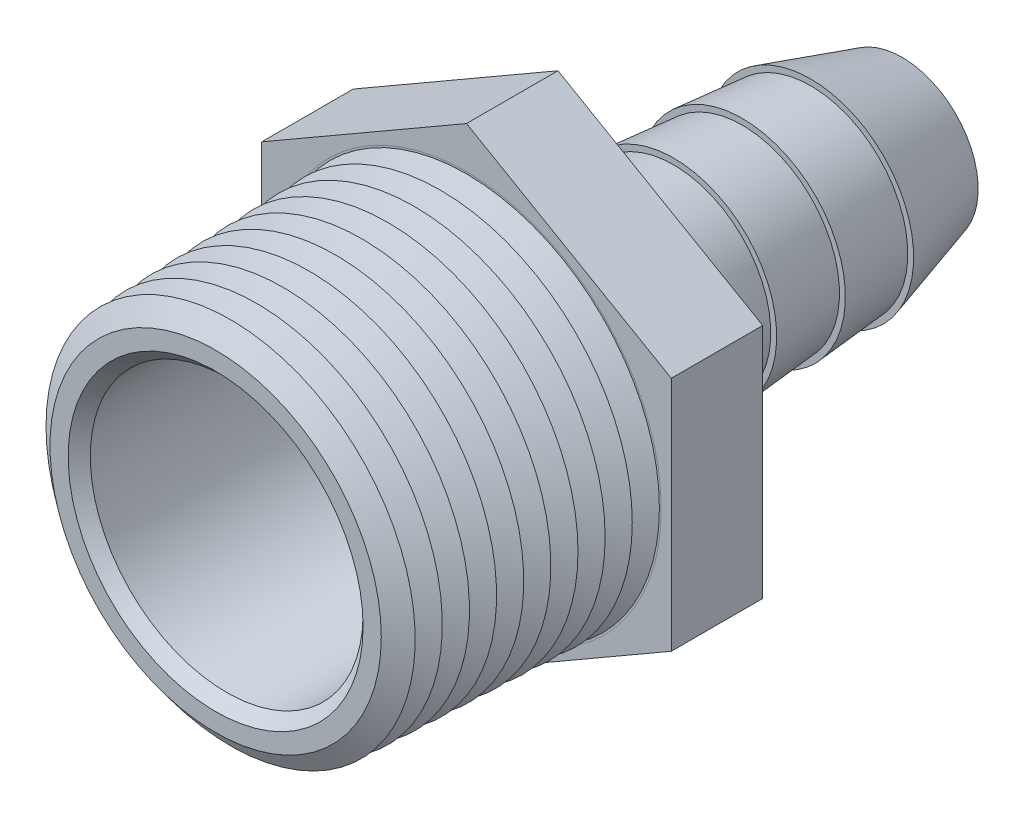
ISO-10303-21;
HEADER;
FILE_DESCRIPTION(('STEP AP214'),'2;1');
FILE_NAME('part.step','',(''),(''),'','','');
FILE_SCHEMA(('AUTOMOTIVE_DESIGN { 1 0 10303 214 1 1 1 1 }'));
ENDSEC;
DATA;
#1=APPLICATION_CONTEXT('core data for automotive mechanical design processes');
#2=APPLICATION_PROTOCOL_DEFINITION('international standard','automotive_design',2000,#1);
#3=PRODUCT_CONTEXT('',#1,'mechanical');
#4=PRODUCT('Part','Part','',(#3));
#5=PRODUCT_RELATED_PRODUCT_CATEGORY('part','',(#4));
#6=PRODUCT_DEFINITION_FORMATION('','',#4);
#7=PRODUCT_DEFINITION_CONTEXT('part definition',#1,'design');
#8=PRODUCT_DEFINITION('design','',#6,#7);
#9=PRODUCT_DEFINITION_SHAPE('','',#8);
#10=(LENGTH_UNIT() NAMED_UNIT(*) SI_UNIT(.MILLI.,.METRE.));
#11=(NAMED_UNIT(*) PLANE_ANGLE_UNIT() SI_UNIT($,.RADIAN.));
#12=(NAMED_UNIT(*) SI_UNIT($,.STERADIAN.) SOLID_ANGLE_UNIT());
#13=UNCERTAINTY_MEASURE_WITH_UNIT(LENGTH_MEASURE(1.E-05),#10,'distance_accuracy_value','');
#14=(GEOMETRIC_REPRESENTATION_CONTEXT(3) GLOBAL_UNCERTAINTY_ASSIGNED_CONTEXT((#13)) GLOBAL_UNIT_ASSIGNED_CONTEXT((#10,
#11,#12)) REPRESENTATION_CONTEXT('',''));
#15=CARTESIAN_POINT('',(0.,0.,0.));
#16=DIRECTION('',(0.,0.,1.));
#17=DIRECTION('',(1.,0.,0.));
#18=AXIS2_PLACEMENT_3D('',#15,#16,#17);
#19=CARTESIAN_POINT('',(14.1605,-8.1755684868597,30.1244));
#20=DIRECTION('',(0.,0.,1.));
#21=DIRECTION('',(1.,0.,0.));
#22=AXIS2_PLACEMENT_3D('',#19,#20,#21);
#23=PLANE('',#22);
#24=DIRECTION('',(0.866025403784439,0.5,0.));
#25=VECTOR('',#24,1.);
#26=CARTESIAN_POINT('',(0.,-16.3511369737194,30.1244));
#27=LINE('',#26,#25);
#28=CARTESIAN_POINT('',(0.,-16.3511369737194,30.1244));
#29=VERTEX_POINT('',#28);
#30=CARTESIAN_POINT('',(14.1605,-8.1755684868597,30.1244));
#31=VERTEX_POINT('',#30);
#32=EDGE_CURVE('E127',#29,#31,#27,.T.);
#33=ORIENTED_EDGE('',*,*,#32,.T.);
#34=DIRECTION('',(0.,1.,0.));
#35=VECTOR('',#34,1.);
#36=CARTESIAN_POINT('',(14.1605,-8.1755684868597,30.1244));
#37=LINE('',#36,#35);
#38=CARTESIAN_POINT('',(14.1605,8.1755684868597,30.1244));
#39=VERTEX_POINT('',#38);
#40=EDGE_CURVE('E104',#31,#39,#37,.T.);
#41=ORIENTED_EDGE('',*,*,#40,.T.);
#42=DIRECTION('',(-0.866025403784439,0.5,0.));
#43=VECTOR('',#42,1.);
#44=CARTESIAN_POINT('',(14.1605,8.1755684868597,30.1244));
#45=LINE('',#44,#43);
#46=CARTESIAN_POINT('',(0.,16.3511369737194,30.1244));
#47=VERTEX_POINT('',#46);
#48=EDGE_CURVE('E130',#39,#47,#45,.T.);
#49=ORIENTED_EDGE('',*,*,#48,.T.);
#50=DIRECTION('',(-0.866025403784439,-0.5,0.));
#51=VECTOR('',#50,1.);
#52=CARTESIAN_POINT('',(0.,16.3511369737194,30.1244));
#53=LINE('',#52,#51);
#54=CARTESIAN_POINT('',(-14.1605,8.1755684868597,30.1244));
#55=VERTEX_POINT('',#54);
#56=EDGE_CURVE('E132',#47,#55,#53,.T.);
#57=ORIENTED_EDGE('',*,*,#56,.T.);
#58=DIRECTION('',(0.,-1.,0.));
#59=VECTOR('',#58,1.);
#60=CARTESIAN_POINT('',(-14.1605,8.1755684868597,30.1244));
#61=LINE('',#60,#59);
#62=CARTESIAN_POINT('',(-14.1605,-8.17556848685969,30.1244));
#63=VERTEX_POINT('',#62);
#64=EDGE_CURVE('E55',#55,#63,#61,.T.);
#65=ORIENTED_EDGE('',*,*,#64,.T.);
#66=DIRECTION('',(0.866025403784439,-0.5,0.));
#67=VECTOR('',#66,1.);
#68=CARTESIAN_POINT('',(-14.1605,-8.17556848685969,30.1244));
#69=LINE('',#68,#67);
#70=EDGE_CURVE('E50',#63,#29,#69,.T.);
#71=ORIENTED_EDGE('',*,*,#70,.T.);
#72=EDGE_LOOP('',(#33,#41,#49,#57,#65,#71));
#73=FACE_BOUND('',#72,.T.);
#74=CARTESIAN_POINT('',(0.,0.,30.1244));
#75=DIRECTION('',(0.,0.,-1.));
#76=DIRECTION('',(-1.,0.,0.));
#77=AXIS2_PLACEMENT_3D('',#74,#75,#76);
#78=CIRCLE('',#77,13.46835);
#79=CARTESIAN_POINT('',(-13.46835,0.,30.1244));
#80=VERTEX_POINT('',#79);
#81=EDGE_CURVE('E614',#80,#80,#78,.T.);
#82=ORIENTED_EDGE('',*,*,#81,.T.);
#83=EDGE_LOOP('',(#82));
#84=FACE_BOUND('',#83,.T.);
#85=ADVANCED_FACE('F34',(#73,#84),#23,.T.);
#86=CARTESIAN_POINT('',(0.,0.,47.4726));
#87=DIRECTION('',(0.,0.,1.));
#88=DIRECTION('',(1.,0.,0.));
#89=AXIS2_PLACEMENT_3D('',#86,#87,#88);
#90=PLANE('',#89);
#91=CARTESIAN_POINT('',(0.,0.,47.4726));
#92=DIRECTION('',(0.,0.,1.));
#93=DIRECTION('',(1.,0.,0.));
#94=AXIS2_PLACEMENT_3D('',#91,#92,#93);
#95=CIRCLE('',#94,10.1981);
#96=CARTESIAN_POINT('',(10.1981,0.,47.4726));
#97=VERTEX_POINT('',#96);
#98=EDGE_CURVE('E11',#97,#97,#95,.F.);
#99=ORIENTED_EDGE('',*,*,#98,.T.);
#100=EDGE_LOOP('',(#99));
#101=FACE_BOUND('',#100,.T.);
#102=CARTESIAN_POINT('',(0.,0.,47.4726));
#103=DIRECTION('',(0.,0.,1.));
#104=DIRECTION('',(1.,0.,0.));
#105=AXIS2_PLACEMENT_3D('',#102,#103,#104);
#106=CIRCLE('',#105,11.4553988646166);
#107=CARTESIAN_POINT('',(11.4553988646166,0.,47.4726));
#108=VERTEX_POINT('',#107);
#109=EDGE_CURVE('E38',#108,#108,#106,.T.);
#110=ORIENTED_EDGE('',*,*,#109,.T.);
#111=EDGE_LOOP('',(#110));
#112=FACE_BOUND('',#111,.T.);
#113=ADVANCED_FACE('F195',(#101,#112),#90,.T.);
#114=CARTESIAN_POINT('',(0.,0.,6.3246));
#115=DIRECTION('',(0.,0.,1.));
#116=DIRECTION('',(1.,0.,0.));
#117=AXIS2_PLACEMENT_3D('',#114,#115,#116);
#118=CONICAL_SURFACE('',#117,7.1247,0.287029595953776);
#119=CARTESIAN_POINT('',(0.,0.,0.));
#120=DIRECTION('',(0.,0.,-1.));
#121=DIRECTION('',(-1.,0.,0.));
#122=AXIS2_PLACEMENT_3D('',#119,#120,#121);
#123=CIRCLE('',#122,5.2578);
#124=CARTESIAN_POINT('',(-5.2578,0.,0.));
#125=VERTEX_POINT('',#124);
#126=EDGE_CURVE('E167',#125,#125,#123,.T.);
#127=ORIENTED_EDGE('',*,*,#126,.F.);
#128=EDGE_LOOP('',(#127));
#129=FACE_BOUND('',#128,.T.);
#130=CARTESIAN_POINT('',(0.,0.,6.3246));
#131=DIRECTION('',(0.,0.,-1.));
#132=DIRECTION('',(-1.,0.,0.));
#133=AXIS2_PLACEMENT_3D('',#130,#131,#132);
#134=CIRCLE('',#133,7.1247);
#135=CARTESIAN_POINT('',(-7.1247,0.,6.3246));
#136=VERTEX_POINT('',#135);
#137=EDGE_CURVE('E107',#136,#136,#134,.T.);
#138=ORIENTED_EDGE('',*,*,#137,.T.);
#139=EDGE_LOOP('',(#138));
#140=FACE_BOUND('',#139,.T.);
#141=ADVANCED_FACE('F200',(#129,#140),#118,.T.);
#142=CARTESIAN_POINT('',(0.,0.,20.5232));
#143=DIRECTION('',(0.,0.,1.));
#144=DIRECTION('',(1.,0.,0.));
#145=AXIS2_PLACEMENT_3D('',#142,#143,#144);
#146=CONICAL_SURFACE('',#145,7.1247,0.0858102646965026);
#147=CARTESIAN_POINT('',(0.,0.,15.7988));
#148=DIRECTION('',(0.,0.,-1.));
#149=DIRECTION('',(-1.,0.,0.));
#150=AXIS2_PLACEMENT_3D('',#147,#148,#149);
#151=CIRCLE('',#150,6.7183);
#152=CARTESIAN_POINT('',(-6.7183,0.,15.7988));
#153=VERTEX_POINT('',#152);
#154=EDGE_CURVE('E161',#153,#153,#151,.T.);
#155=ORIENTED_EDGE('',*,*,#154,.F.);
#156=EDGE_LOOP('',(#155));
#157=FACE_BOUND('',#156,.T.);
#158=CARTESIAN_POINT('',(0.,0.,20.5232));
#159=DIRECTION('',(0.,0.,-1.));
#160=DIRECTION('',(-1.,0.,0.));
#161=AXIS2_PLACEMENT_3D('',#158,#159,#160);
#162=CIRCLE('',#161,7.1247);
#163=CARTESIAN_POINT('',(-7.1247,0.,20.5232));
#164=VERTEX_POINT('',#163);
#165=EDGE_CURVE('E164',#164,#164,#162,.T.);
#166=ORIENTED_EDGE('',*,*,#165,.T.);
#167=EDGE_LOOP('',(#166));
#168=FACE_BOUND('',#167,.T.);
#169=ADVANCED_FACE('F247',(#157,#168),#146,.T.);
#170=CARTESIAN_POINT('',(-7.1247,0.,15.7988));
#171=DIRECTION('',(0.,0.,-1.));
#172=DIRECTION('',(-1.,0.,0.));
#173=AXIS2_PLACEMENT_3D('',#170,#171,#172);
#174=PLANE('',#173);
#175=CARTESIAN_POINT('',(0.,0.,15.7988));
#176=DIRECTION('',(0.,0.,-1.));
#177=DIRECTION('',(-1.,0.,0.));
#178=AXIS2_PLACEMENT_3D('',#175,#176,#177);
#179=CIRCLE('',#178,7.1247);
#180=CARTESIAN_POINT('',(-7.1247,0.,15.7988));
#181=VERTEX_POINT('',#180);
#182=EDGE_CURVE('E158',#181,#181,#179,.T.);
#183=ORIENTED_EDGE('',*,*,#182,.F.);
#184=EDGE_LOOP('',(#183));
#185=FACE_BOUND('',#184,.T.);
#186=ORIENTED_EDGE('',*,*,#154,.T.);
#187=EDGE_LOOP('',(#186));
#188=FACE_BOUND('',#187,.T.);
#189=ADVANCED_FACE('F243',(#185,#188),#174,.F.);
#190=CARTESIAN_POINT('',(0.,0.,15.7988));
#191=DIRECTION('',(0.,0.,1.));
#192=DIRECTION('',(1.,0.,0.));
#193=AXIS2_PLACEMENT_3D('',#190,#191,#192);
#194=CONICAL_SURFACE('',#193,7.1247,0.0853536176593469);
#195=CARTESIAN_POINT('',(0.,0.,11.049));
#196=DIRECTION('',(0.,0.,-1.));
#197=DIRECTION('',(-1.,0.,0.));
#198=AXIS2_PLACEMENT_3D('',#195,#196,#197);
#199=CIRCLE('',#198,6.7183);
#200=CARTESIAN_POINT('',(-6.7183,0.,11.049));
#201=VERTEX_POINT('',#200);
#202=EDGE_CURVE('E155',#201,#201,#199,.T.);
#203=ORIENTED_EDGE('',*,*,#202,.F.);
#204=EDGE_LOOP('',(#203));
#205=FACE_BOUND('',#204,.T.);
#206=ORIENTED_EDGE('',*,*,#182,.T.);
#207=EDGE_LOOP('',(#206));
#208=FACE_BOUND('',#207,.T.);
#209=ADVANCED_FACE('F239',(#205,#208),#194,.T.);
#210=CARTESIAN_POINT('',(-7.1247,0.,11.049));
#211=DIRECTION('',(0.,0.,-1.));
#212=DIRECTION('',(-1.,0.,0.));
#213=AXIS2_PLACEMENT_3D('',#210,#211,#212);
#214=PLANE('',#213);
#215=CARTESIAN_POINT('',(0.,0.,11.049));
#216=DIRECTION('',(0.,0.,-1.));
#217=DIRECTION('',(-1.,0.,0.));
#218=AXIS2_PLACEMENT_3D('',#215,#216,#217);
#219=CIRCLE('',#218,7.1247);
#220=CARTESIAN_POINT('',(-7.1247,0.,11.049));
#221=VERTEX_POINT('',#220);
#222=EDGE_CURVE('E152',#221,#221,#219,.T.);
#223=ORIENTED_EDGE('',*,*,#222,.F.);
#224=EDGE_LOOP('',(#223));
#225=FACE_BOUND('',#224,.T.);
#226=ORIENTED_EDGE('',*,*,#202,.T.);
#227=EDGE_LOOP('',(#226));
#228=FACE_BOUND('',#227,.T.);
#229=ADVANCED_FACE('F235',(#225,#228),#214,.F.);
#230=CARTESIAN_POINT('',(0.,0.,11.049));
#231=DIRECTION('',(0.,0.,1.));
#232=DIRECTION('',(1.,0.,0.));
#233=AXIS2_PLACEMENT_3D('',#230,#231,#232);
#234=CONICAL_SURFACE('',#233,7.1247,0.0858102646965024);
#235=CARTESIAN_POINT('',(0.,0.,6.3246));
#236=DIRECTION('',(0.,0.,-1.));
#237=DIRECTION('',(-1.,0.,0.));
#238=AXIS2_PLACEMENT_3D('',#235,#236,#237);
#239=CIRCLE('',#238,6.7183);
#240=CARTESIAN_POINT('',(-6.7183,0.,6.3246));
#241=VERTEX_POINT('',#240);
#242=EDGE_CURVE('E149',#241,#241,#239,.T.);
#243=ORIENTED_EDGE('',*,*,#242,.F.);
#244=EDGE_LOOP('',(#243));
#245=FACE_BOUND('',#244,.T.);
#246=ORIENTED_EDGE('',*,*,#222,.T.);
#247=EDGE_LOOP('',(#246));
#248=FACE_BOUND('',#247,.T.);
#249=ADVANCED_FACE('F231',(#245,#248),#234,.T.);
#250=CARTESIAN_POINT('',(-7.1247,0.,6.3246));
#251=DIRECTION('',(0.,0.,-1.));
#252=DIRECTION('',(-1.,0.,0.));
#253=AXIS2_PLACEMENT_3D('',#250,#251,#252);
#254=PLANE('',#253);
#255=ORIENTED_EDGE('',*,*,#137,.F.);
#256=EDGE_LOOP('',(#255));
#257=FACE_BOUND('',#256,.T.);
#258=ORIENTED_EDGE('',*,*,#242,.T.);
#259=EDGE_LOOP('',(#258));
#260=FACE_BOUND('',#259,.T.);
#261=ADVANCED_FACE('F227',(#257,#260),#254,.F.);
#262=CARTESIAN_POINT('',(0.,0.,0.));
#263=DIRECTION('',(0.,0.,1.));
#264=DIRECTION('',(1.,0.,0.));
#265=AXIS2_PLACEMENT_3D('',#262,#263,#264);
#266=PLANE('',#265);
#267=CARTESIAN_POINT('',(0.,0.,0.));
#268=DIRECTION('',(0.,0.,-1.));
#269=DIRECTION('',(-1.,0.,0.));
#270=AXIS2_PLACEMENT_3D('',#267,#268,#269);
#271=CIRCLE('',#270,4.6482);
#272=CARTESIAN_POINT('',(-4.6482,0.,0.));
#273=VERTEX_POINT('',#272);
#274=EDGE_CURVE('E113',#273,#273,#271,.T.);
#275=ORIENTED_EDGE('',*,*,#274,.F.);
#276=EDGE_LOOP('',(#275));
#277=FACE_BOUND('',#276,.T.);
#278=ORIENTED_EDGE('',*,*,#126,.T.);
#279=EDGE_LOOP('',(#278));
#280=FACE_BOUND('',#279,.T.);
#281=ADVANCED_FACE('F230',(#277,#280),#266,.F.);
#282=CARTESIAN_POINT('',(0.,0.,23.7998));
#283=DIRECTION('',(0.,0.,-1.));
#284=DIRECTION('',(-1.,0.,0.));
#285=AXIS2_PLACEMENT_3D('',#282,#283,#284);
#286=CYLINDRICAL_SURFACE('',#285,7.1247);
#287=ORIENTED_EDGE('',*,*,#165,.F.);
#288=EDGE_LOOP('',(#287));
#289=FACE_BOUND('',#288,.T.);
#290=CARTESIAN_POINT('',(0.,0.,23.7998));
#291=DIRECTION('',(0.,0.,1.));
#292=DIRECTION('',(1.,0.,0.));
#293=AXIS2_PLACEMENT_3D('',#290,#291,#292);
#294=CIRCLE('',#293,7.1247);
#295=CARTESIAN_POINT('',(7.1247,0.,23.7998));
#296=VERTEX_POINT('',#295);
#297=EDGE_CURVE('E170',#296,#296,#294,.T.);
#298=ORIENTED_EDGE('',*,*,#297,.F.);
#299=EDGE_LOOP('',(#298));
#300=FACE_BOUND('',#299,.T.);
#301=ADVANCED_FACE('F36',(#289,#300),#286,.T.);
#302=CARTESIAN_POINT('',(14.1605,-8.1755684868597,23.7998));
#303=DIRECTION('',(0.,0.,1.));
#304=DIRECTION('',(1.,0.,0.));
#305=AXIS2_PLACEMENT_3D('',#302,#303,#304);
#306=PLANE('',#305);
#307=DIRECTION('',(0.866025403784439,0.5,0.));
#308=VECTOR('',#307,1.);
#309=CARTESIAN_POINT('',(0.,-16.3511369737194,23.7998));
#310=LINE('',#309,#308);
#311=CARTESIAN_POINT('',(0.,-16.3511369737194,23.7998));
#312=VERTEX_POINT('',#311);
#313=CARTESIAN_POINT('',(14.1605,-8.1755684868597,23.7998));
#314=VERTEX_POINT('',#313);
#315=EDGE_CURVE('E94',#312,#314,#310,.T.);
#316=ORIENTED_EDGE('',*,*,#315,.F.);
#317=DIRECTION('',(0.866025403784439,-0.5,0.));
#318=VECTOR('',#317,1.);
#319=CARTESIAN_POINT('',(-14.1605,-8.17556848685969,23.7998));
#320=LINE('',#319,#318);
#321=CARTESIAN_POINT('',(-14.1605,-8.17556848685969,23.7998));
#322=VERTEX_POINT('',#321);
#323=EDGE_CURVE('E125',#322,#312,#320,.T.);
#324=ORIENTED_EDGE('',*,*,#323,.F.);
#325=DIRECTION('',(0.,-1.,0.));
#326=VECTOR('',#325,1.);
#327=CARTESIAN_POINT('',(-14.1605,8.1755684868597,23.7998));
#328=LINE('',#327,#326);
#329=CARTESIAN_POINT('',(-14.1605,8.1755684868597,23.7998));
#330=VERTEX_POINT('',#329);
#331=EDGE_CURVE('E123',#330,#322,#328,.T.);
#332=ORIENTED_EDGE('',*,*,#331,.F.);
#333=DIRECTION('',(-0.866025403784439,-0.5,0.));
#334=VECTOR('',#333,1.);
#335=CARTESIAN_POINT('',(0.,16.3511369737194,23.7998));
#336=LINE('',#335,#334);
#337=CARTESIAN_POINT('',(0.,16.3511369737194,23.7998));
#338=VERTEX_POINT('',#337);
#339=EDGE_CURVE('E121',#338,#330,#336,.T.);
#340=ORIENTED_EDGE('',*,*,#339,.F.);
#341=DIRECTION('',(-0.866025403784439,0.5,0.));
#342=VECTOR('',#341,1.);
#343=CARTESIAN_POINT('',(14.1605,8.1755684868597,23.7998));
#344=LINE('',#343,#342);
#345=CARTESIAN_POINT('',(14.1605,8.1755684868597,23.7998));
#346=VERTEX_POINT('',#345);
#347=EDGE_CURVE('E96',#346,#338,#344,.T.);
#348=ORIENTED_EDGE('',*,*,#347,.F.);
#349=DIRECTION('',(0.,1.,0.));
#350=VECTOR('',#349,1.);
#351=CARTESIAN_POINT('',(14.1605,-8.1755684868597,23.7998));
#352=LINE('',#351,#350);
#353=EDGE_CURVE('E88',#314,#346,#352,.T.);
#354=ORIENTED_EDGE('',*,*,#353,.F.);
#355=EDGE_LOOP('',(#316,#324,#332,#340,#348,#354));
#356=FACE_BOUND('',#355,.T.);
#357=ORIENTED_EDGE('',*,*,#297,.T.);
#358=EDGE_LOOP('',(#357));
#359=FACE_BOUND('',#358,.T.);
#360=ADVANCED_FACE('F90',(#356,#359),#306,.F.);
#361=CARTESIAN_POINT('',(0.,-16.3511369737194,30.1244));
#362=DIRECTION('',(-0.5,0.866025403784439,0.));
#363=DIRECTION('',(-0.866025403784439,-0.5,0.));
#364=AXIS2_PLACEMENT_3D('',#361,#362,#363);
#365=PLANE('',#364);
#366=ORIENTED_EDGE('',*,*,#315,.T.);
#367=DIRECTION('',(0.,0.,-1.));
#368=VECTOR('',#367,1.);
#369=CARTESIAN_POINT('',(14.1605,-8.1755684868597,30.1244));
#370=LINE('',#369,#368);
#371=EDGE_CURVE('E102',#31,#314,#370,.T.);
#372=ORIENTED_EDGE('',*,*,#371,.F.);
#373=ORIENTED_EDGE('',*,*,#32,.F.);
#374=DIRECTION('',(0.,0.,-1.));
#375=VECTOR('',#374,1.);
#376=CARTESIAN_POINT('',(0.,-16.3511369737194,30.1244));
#377=LINE('',#376,#375);
#378=EDGE_CURVE('E112',#29,#312,#377,.T.);
#379=ORIENTED_EDGE('',*,*,#378,.T.);
#380=EDGE_LOOP('',(#366,#372,#373,#379));
#381=FACE_BOUND('',#380,.T.);
#382=ADVANCED_FACE('F111',(#381),#365,.F.);
#383=CARTESIAN_POINT('',(14.1605,-8.1755684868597,30.1244));
#384=DIRECTION('',(-1.,0.,0.));
#385=DIRECTION('',(0.,-1.,0.));
#386=AXIS2_PLACEMENT_3D('',#383,#384,#385);
#387=PLANE('',#386);
#388=ORIENTED_EDGE('',*,*,#353,.T.);
#389=DIRECTION('',(0.,0.,-1.));
#390=VECTOR('',#389,1.);
#391=CARTESIAN_POINT('',(14.1605,8.1755684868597,30.1244));
#392=LINE('',#391,#390);
#393=EDGE_CURVE('E108',#39,#346,#392,.T.);
#394=ORIENTED_EDGE('',*,*,#393,.F.);
#395=ORIENTED_EDGE('',*,*,#40,.F.);
#396=ORIENTED_EDGE('',*,*,#371,.T.);
#397=EDGE_LOOP('',(#388,#394,#395,#396));
#398=FACE_BOUND('',#397,.T.);
#399=ADVANCED_FACE('F103',(#398),#387,.F.);
#400=CARTESIAN_POINT('',(14.1605,8.1755684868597,30.1244));
#401=DIRECTION('',(-0.5,-0.866025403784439,0.));
#402=DIRECTION('',(0.866025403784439,-0.5,0.));
#403=AXIS2_PLACEMENT_3D('',#400,#401,#402);
#404=PLANE('',#403);
#405=ORIENTED_EDGE('',*,*,#347,.T.);
#406=DIRECTION('',(0.,0.,-1.));
#407=VECTOR('',#406,1.);
#408=CARTESIAN_POINT('',(0.,16.3511369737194,30.1244));
#409=LINE('',#408,#407);
#410=EDGE_CURVE('E143',#47,#338,#409,.T.);
#411=ORIENTED_EDGE('',*,*,#410,.F.);
#412=ORIENTED_EDGE('',*,*,#48,.F.);
#413=ORIENTED_EDGE('',*,*,#393,.T.);
#414=EDGE_LOOP('',(#405,#411,#412,#413));
#415=FACE_BOUND('',#414,.T.);
#416=ADVANCED_FACE('F218',(#415),#404,.F.);
#417=CARTESIAN_POINT('',(0.,16.3511369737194,30.1244));
#418=DIRECTION('',(0.5,-0.866025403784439,0.));
#419=DIRECTION('',(0.866025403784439,0.5,0.));
#420=AXIS2_PLACEMENT_3D('',#417,#418,#419);
#421=PLANE('',#420);
#422=ORIENTED_EDGE('',*,*,#339,.T.);
#423=DIRECTION('',(0.,0.,-1.));
#424=VECTOR('',#423,1.);
#425=CARTESIAN_POINT('',(-14.1605,8.1755684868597,30.1244));
#426=LINE('',#425,#424);
#427=EDGE_CURVE('E140',#55,#330,#426,.T.);
#428=ORIENTED_EDGE('',*,*,#427,.F.);
#429=ORIENTED_EDGE('',*,*,#56,.F.);
#430=ORIENTED_EDGE('',*,*,#410,.T.);
#431=EDGE_LOOP('',(#422,#428,#429,#430));
#432=FACE_BOUND('',#431,.T.);
#433=ADVANCED_FACE('F214',(#432),#421,.F.);
#434=CARTESIAN_POINT('',(-14.1605,8.1755684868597,30.1244));
#435=DIRECTION('',(1.,0.,0.));
#436=DIRECTION('',(0.,1.,0.));
#437=AXIS2_PLACEMENT_3D('',#434,#435,#436);
#438=PLANE('',#437);
#439=ORIENTED_EDGE('',*,*,#331,.T.);
#440=DIRECTION('',(0.,0.,-1.));
#441=VECTOR('',#440,1.);
#442=CARTESIAN_POINT('',(-14.1605,-8.17556848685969,30.1244));
#443=LINE('',#442,#441);
#444=EDGE_CURVE('E137',#63,#322,#443,.T.);
#445=ORIENTED_EDGE('',*,*,#444,.F.);
#446=ORIENTED_EDGE('',*,*,#64,.F.);
#447=ORIENTED_EDGE('',*,*,#427,.T.);
#448=EDGE_LOOP('',(#439,#445,#446,#447));
#449=FACE_BOUND('',#448,.T.);
#450=ADVANCED_FACE('F210',(#449),#438,.F.);
#451=CARTESIAN_POINT('',(-14.1605,-8.17556848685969,30.1244));
#452=DIRECTION('',(0.5,0.866025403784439,0.));
#453=DIRECTION('',(-0.866025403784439,0.5,0.));
#454=AXIS2_PLACEMENT_3D('',#451,#452,#453);
#455=PLANE('',#454);
#456=ORIENTED_EDGE('',*,*,#323,.T.);
#457=ORIENTED_EDGE('',*,*,#378,.F.);
#458=ORIENTED_EDGE('',*,*,#70,.F.);
#459=ORIENTED_EDGE('',*,*,#444,.T.);
#460=EDGE_LOOP('',(#456,#457,#458,#459));
#461=FACE_BOUND('',#460,.T.);
#462=ADVANCED_FACE('F206',(#461),#455,.F.);
#463=CARTESIAN_POINT('',(0.,0.,0.));
#464=DIRECTION('',(0.,0.,-1.));
#465=DIRECTION('',(-1.,0.,0.));
#466=AXIS2_PLACEMENT_3D('',#463,#464,#465);
#467=CONICAL_SURFACE('',#466,4.6482,0.00436332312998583);
#468=CARTESIAN_POINT('',(0.,0.,26.9748));
#469=DIRECTION('',(0.,0.,-1.));
#470=DIRECTION('',(-1.,0.,0.));
#471=AXIS2_PLACEMENT_3D('',#468,#469,#470);
#472=CIRCLE('',#471,4.53049948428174);
#473=CARTESIAN_POINT('',(-4.53049948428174,0.,26.9748));
#474=VERTEX_POINT('',#473);
#475=EDGE_CURVE('E116',#474,#474,#472,.F.);
#476=ORIENTED_EDGE('',*,*,#475,.T.);
#477=EDGE_LOOP('',(#476));
#478=FACE_BOUND('',#477,.T.);
#479=ORIENTED_EDGE('',*,*,#274,.T.);
#480=EDGE_LOOP('',(#479));
#481=FACE_BOUND('',#480,.T.);
#482=ADVANCED_FACE('F209',(#478,#481),#467,.F.);
#483=CARTESIAN_POINT('',(0.,0.,26.9748));
#484=DIRECTION('',(0.,0.,-1.));
#485=DIRECTION('',(-1.,0.,0.));
#486=AXIS2_PLACEMENT_3D('',#483,#484,#485);
#487=PLANE('',#486);
#488=CARTESIAN_POINT('',(0.,0.,26.9748));
#489=DIRECTION('',(0.,0.,-1.));
#490=DIRECTION('',(-1.,0.,0.));
#491=AXIS2_PLACEMENT_3D('',#488,#489,#490);
#492=CIRCLE('',#491,9.34666090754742);
#493=CARTESIAN_POINT('',(-9.34666090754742,0.,26.9748));
#494=VERTEX_POINT('',#493);
#495=EDGE_CURVE('E617',#494,#494,#492,.F.);
#496=ORIENTED_EDGE('',*,*,#495,.T.);
#497=EDGE_LOOP('',(#496));
#498=FACE_BOUND('',#497,.T.);
#499=ORIENTED_EDGE('',*,*,#475,.F.);
#500=EDGE_LOOP('',(#499));
#501=FACE_BOUND('',#500,.T.);
#502=ADVANCED_FACE('F191',(#498,#501),#487,.F.);
#503=CARTESIAN_POINT('',(0.,0.,47.4726));
#504=DIRECTION('',(0.,0.,1.));
#505=DIRECTION('',(1.,0.,0.));
#506=AXIS2_PLACEMENT_3D('',#503,#504,#505);
#507=CONICAL_SURFACE('',#506,9.4361,0.00436332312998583);
#508=CARTESIAN_POINT('',(0.,0.,46.7072605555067));
#509=DIRECTION('',(0.,0.,1.));
#510=DIRECTION('',(1.,0.,0.));
#511=AXIS2_PLACEMENT_3D('',#508,#509,#510);
#512=CIRCLE('',#511,9.43276055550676);
#513=CARTESIAN_POINT('',(9.43276055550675,0.,46.7072605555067));
#514=VERTEX_POINT('',#513);
#515=EDGE_CURVE('E43',#514,#514,#512,.T.);
#516=ORIENTED_EDGE('',*,*,#515,.T.);
#517=EDGE_LOOP('',(#516));
#518=FACE_BOUND('',#517,.T.);
#519=ORIENTED_EDGE('',*,*,#495,.F.);
#520=EDGE_LOOP('',(#519));
#521=FACE_BOUND('',#520,.T.);
#522=ADVANCED_FACE('F176',(#518,#521),#507,.F.);
#523=CARTESIAN_POINT('',(0.,0.,46.7072605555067));
#524=DIRECTION('',(0.,0.,1.));
#525=DIRECTION('',(1.,0.,0.));
#526=AXIS2_PLACEMENT_3D('',#523,#524,#525);
#527=CONICAL_SURFACE('',#526,9.43276055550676,0.785398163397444);
#528=CARTESIAN_POINT('',(10.1981,0.,47.4726));
#529=CARTESIAN_POINT('',(10.1901277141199,0.,47.4646277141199));
#530=CARTESIAN_POINT('',(10.1821554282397,0.,47.4566554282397));
#531=CARTESIAN_POINT('',(10.1662108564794,0.,47.4407108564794));
#532=CARTESIAN_POINT('',(10.1582385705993,0.,47.4327385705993));
#533=CARTESIAN_POINT('',(10.142293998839,0.,47.416793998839));
#534=CARTESIAN_POINT('',(10.1343217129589,0.,47.4088217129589));
#535=CARTESIAN_POINT('',(10.1183771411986,0.,47.3928771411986));
#536=CARTESIAN_POINT('',(10.1104048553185,0.,47.3849048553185));
#537=CARTESIAN_POINT('',(10.0944602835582,0.,47.3689602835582));
#538=CARTESIAN_POINT('',(10.0864879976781,0.,47.3609879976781));
#539=CARTESIAN_POINT('',(10.0705434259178,0.,47.3450434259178));
#540=CARTESIAN_POINT('',(10.0625711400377,0.,47.3370711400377));
#541=CARTESIAN_POINT('',(10.0466265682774,0.,47.3211265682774));
#542=CARTESIAN_POINT('',(10.0386542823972,0.,47.3131542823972));
#543=CARTESIAN_POINT('',(10.022709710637,0.,47.297209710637));
#544=CARTESIAN_POINT('',(10.0147374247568,0.,47.2892374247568));
#545=CARTESIAN_POINT('',(9.99879285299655,0.,47.2732928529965));
#546=CARTESIAN_POINT('',(9.99082056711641,0.,47.2653205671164));
#547=CARTESIAN_POINT('',(9.97487599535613,0.,47.2493759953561));
#548=CARTESIAN_POINT('',(9.96690370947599,0.,47.241403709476));
#549=CARTESIAN_POINT('',(9.95095913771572,0.,47.2254591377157));
#550=CARTESIAN_POINT('',(9.94298685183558,0.,47.2174868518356));
#551=CARTESIAN_POINT('',(9.92704228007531,0.,47.2015422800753));
#552=CARTESIAN_POINT('',(9.91906999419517,0.,47.1935699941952));
#553=CARTESIAN_POINT('',(9.90312542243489,0.,47.1776254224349));
#554=CARTESIAN_POINT('',(9.89515313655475,0.,47.1696531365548));
#555=CARTESIAN_POINT('',(9.87920856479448,0.,47.1537085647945));
#556=CARTESIAN_POINT('',(9.87123627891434,0.,47.1457362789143));
#557=CARTESIAN_POINT('',(9.85529170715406,0.,47.1297917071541));
#558=CARTESIAN_POINT('',(9.84731942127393,0.,47.1218194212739));
#559=CARTESIAN_POINT('',(9.83137484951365,0.,47.1058748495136));
#560=CARTESIAN_POINT('',(9.82340256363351,0.,47.0979025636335));
#561=CARTESIAN_POINT('',(9.80745799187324,0.,47.0819579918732));
#562=CARTESIAN_POINT('',(9.7994857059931,0.,47.0739857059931));
#563=CARTESIAN_POINT('',(9.78354113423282,0.,47.0580411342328));
#564=CARTESIAN_POINT('',(9.77556884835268,0.,47.0500688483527));
#565=CARTESIAN_POINT('',(9.75962427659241,0.,47.0341242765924));
#566=CARTESIAN_POINT('',(9.75165199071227,0.,47.0261519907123));
#567=CARTESIAN_POINT('',(9.73570741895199,0.,47.010207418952));
#568=CARTESIAN_POINT('',(9.72773513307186,0.,47.0022351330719));
#569=CARTESIAN_POINT('',(9.71179056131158,0.,46.9862905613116));
#570=CARTESIAN_POINT('',(9.70381827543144,0.,46.9783182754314));
#571=CARTESIAN_POINT('',(9.68787370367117,0.,46.9623737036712));
#572=CARTESIAN_POINT('',(9.67990141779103,0.,46.954401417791));
#573=CARTESIAN_POINT('',(9.66395684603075,0.,46.9384568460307));
#574=CARTESIAN_POINT('',(9.65598456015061,0.,46.9304845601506));
#575=CARTESIAN_POINT('',(9.64003998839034,0.,46.9145399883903));
#576=CARTESIAN_POINT('',(9.6320677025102,0.,46.9065677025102));
#577=CARTESIAN_POINT('',(9.61612313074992,0.,46.8906231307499));
#578=CARTESIAN_POINT('',(9.60815084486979,0.,46.8826508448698));
#579=CARTESIAN_POINT('',(9.59220627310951,0.,46.8667062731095));
#580=CARTESIAN_POINT('',(9.58423398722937,0.,46.8587339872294));
#581=CARTESIAN_POINT('',(9.5682894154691,0.,46.8427894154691));
#582=CARTESIAN_POINT('',(9.56031712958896,0.,46.834817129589));
#583=CARTESIAN_POINT('',(9.54437255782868,0.,46.8188725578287));
#584=CARTESIAN_POINT('',(9.53640027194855,0.,46.8109002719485));
#585=CARTESIAN_POINT('',(9.52045570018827,0.,46.7949557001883));
#586=CARTESIAN_POINT('',(9.51248341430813,0.,46.7869834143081));
#587=CARTESIAN_POINT('',(9.49653884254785,0.,46.7710388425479));
#588=CARTESIAN_POINT('',(9.48856655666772,0.,46.7630665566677));
#589=CARTESIAN_POINT('',(9.47262198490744,0.,46.7471219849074));
#590=CARTESIAN_POINT('',(9.46464969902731,0.,46.7391496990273));
#591=CARTESIAN_POINT('',(9.44870512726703,0.,46.723205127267));
#592=CARTESIAN_POINT('',(9.44073284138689,0.,46.7152328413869));
#593=CARTESIAN_POINT('',(9.43276055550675,0.,46.7072605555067));
#594=B_SPLINE_CURVE_WITH_KNOTS('',3,(#528,#529,#530,#531,#532,#533,#534,#535,#536,#537,#538,
#539,#540,#541,#542,#543,#544,#545,#546,#547,#548,#549,#550,#551,#552,#553,#554,#555,#556,#557,
#558,#559,#560,#561,#562,#563,#564,#565,#566,#567,#568,#569,#570,#571,#572,#573,#574,#575,#576,
#577,#578,#579,#580,#581,#582,#583,#584,#585,#586,#587,#588,#589,#590,#591,#592,#593),
.UNSPECIFIED.,.F.,.F.,(4,2,2,2,2,2,2,2,2,2,2,2,2,2,2,2,2,2,2,2,2,2,2,2,2,2,2,2,2,2,2,2,4),(0.,
0.0338235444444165,0.067647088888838,0.101470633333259,0.13529417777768,0.169117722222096,
0.202941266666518,0.236764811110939,0.27058835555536,0.304411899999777,0.338235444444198,
0.37205898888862,0.405882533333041,0.439706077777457,0.473529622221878,0.5073531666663,
0.541176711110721,0.575000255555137,0.608823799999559,0.64264734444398,0.6764708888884,
0.710294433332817,0.744117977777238,0.77794152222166,0.811765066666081,0.845588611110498,
0.879412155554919,0.913235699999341,0.947059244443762,0.980882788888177,1.0147063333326,
1.04852987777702,1.08235342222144),.UNSPECIFIED.);
#595=EDGE_CURVE('BSEAM179',#97,#514,#594,.T.);
#596=ORIENTED_EDGE('',*,*,#98,.F.);
#597=ORIENTED_EDGE('',*,*,#515,.F.);
#598=ORIENTED_EDGE('',*,*,#595,.T.);
#599=ORIENTED_EDGE('',*,*,#595,.F.);
#600=EDGE_LOOP('',(#596,#598,#597,#599));
#601=FACE_BOUND('',#600,.T.);
#602=ADVANCED_FACE('F179',(#601),#527,.F.);
#603=CARTESIAN_POINT('',(0.,0.,30.1244));
#604=DIRECTION('',(0.,0.,1.));
#605=DIRECTION('',(1.,0.,0.));
#606=AXIS2_PLACEMENT_3D('',#603,#604,#605);
#607=CONICAL_SURFACE('',#606,13.46835,1.53588974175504);
#608=CARTESIAN_POINT('',(0.,0.,30.1197489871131));
#609=DIRECTION('',(0.,0.,-1.));
#610=DIRECTION('',(-1.,0.,0.));
#611=AXIS2_PLACEMENT_3D('',#608,#609,#610);
#612=CIRCLE('',#611,13.3351624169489);
#613=CARTESIAN_POINT('',(-13.3351624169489,0.,30.1197489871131));
#614=VERTEX_POINT('',#613);
#615=EDGE_CURVE('E611',#614,#614,#612,.T.);
#616=ORIENTED_EDGE('',*,*,#615,.T.);
#617=EDGE_LOOP('',(#616));
#618=FACE_BOUND('',#617,.T.);
#619=ORIENTED_EDGE('',*,*,#81,.F.);
#620=EDGE_LOOP('',(#619));
#621=FACE_BOUND('',#620,.T.);
#622=ADVANCED_FACE('F181',(#618,#621),#607,.F.);
#623=CARTESIAN_POINT('',(0.,0.,30.1197489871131));
#624=DIRECTION('',(0.,0.,-1.));
#625=DIRECTION('',(-1.,0.,0.));
#626=AXIS2_PLACEMENT_3D('',#623,#624,#625);
#627=CONICAL_SURFACE('',#626,13.3351624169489,1.08210413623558);
#628=CARTESIAN_POINT('',(0.,0.,30.9715045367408));
#629=DIRECTION('',(0.,0.,-1.));
#630=DIRECTION('',(-1.,0.,0.));
#631=AXIS2_PLACEMENT_3D('',#628,#629,#630);
#632=CIRCLE('',#631,11.7332432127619);
#633=CARTESIAN_POINT('',(-11.7332432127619,0.,30.9715045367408));
#634=VERTEX_POINT('',#633);
#635=EDGE_CURVE('E608',#634,#634,#632,.T.);
#636=ORIENTED_EDGE('',*,*,#635,.T.);
#637=EDGE_LOOP('',(#636));
#638=FACE_BOUND('',#637,.T.);
#639=ORIENTED_EDGE('',*,*,#615,.F.);
#640=EDGE_LOOP('',(#639));
#641=FACE_BOUND('',#640,.T.);
#642=ADVANCED_FACE('F188',(#638,#641),#627,.T.);
#643=CARTESIAN_POINT('',(0.,0.,30.9715045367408));
#644=DIRECTION('',(0.,0.,1.));
#645=DIRECTION('',(1.,0.,0.));
#646=AXIS2_PLACEMENT_3D('',#643,#644,#645);
#647=CONICAL_SURFACE('',#646,11.7332432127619,1.01229096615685);
#648=CARTESIAN_POINT('',(0.,0.,31.9329294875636));
#649=DIRECTION('',(0.,0.,-1.));
#650=DIRECTION('',(-1.,0.,0.));
#651=AXIS2_PLACEMENT_3D('',#648,#649,#650);
#652=CIRCLE('',#651,13.2718447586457);
#653=CARTESIAN_POINT('',(-13.2718447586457,0.,31.9329294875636));
#654=VERTEX_POINT('',#653);
#655=EDGE_CURVE('E605',#654,#654,#652,.T.);
#656=ORIENTED_EDGE('',*,*,#655,.T.);
#657=EDGE_LOOP('',(#656));
#658=FACE_BOUND('',#657,.T.);
#659=ORIENTED_EDGE('',*,*,#635,.F.);
#660=EDGE_LOOP('',(#659));
#661=FACE_BOUND('',#660,.T.);
#662=ADVANCED_FACE('F355',(#658,#661),#647,.T.);
#663=CARTESIAN_POINT('',(0.,0.,31.9329294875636));
#664=DIRECTION('',(0.,0.,-1.));
#665=DIRECTION('',(-1.,0.,0.));
#666=AXIS2_PLACEMENT_3D('',#663,#664,#665);
#667=CONICAL_SURFACE('',#666,13.2718447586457,1.08210413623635);
#668=CARTESIAN_POINT('',(0.,0.,32.7846850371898));
#669=DIRECTION('',(0.,0.,-1.));
#670=DIRECTION('',(-1.,0.,0.));
#671=AXIS2_PLACEMENT_3D('',#668,#669,#670);
#672=CIRCLE('',#671,11.6699255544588);
#673=CARTESIAN_POINT('',(-11.6699255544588,0.,32.7846850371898));
#674=VERTEX_POINT('',#673);
#675=EDGE_CURVE('E602',#674,#674,#672,.T.);
#676=ORIENTED_EDGE('',*,*,#675,.T.);
#677=EDGE_LOOP('',(#676));
#678=FACE_BOUND('',#677,.T.);
#679=ORIENTED_EDGE('',*,*,#655,.F.);
#680=EDGE_LOOP('',(#679));
#681=FACE_BOUND('',#680,.T.);
#682=ADVANCED_FACE('F365',(#678,#681),#667,.T.);
#683=CARTESIAN_POINT('',(0.,0.,32.7846850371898));
#684=DIRECTION('',(0.,0.,1.));
#685=DIRECTION('',(1.,0.,0.));
#686=AXIS2_PLACEMENT_3D('',#683,#684,#685);
#687=CONICAL_SURFACE('',#686,11.6699255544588,1.01229096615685);
#688=CARTESIAN_POINT('',(0.,0.,33.7461099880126));
#689=DIRECTION('',(0.,0.,-1.));
#690=DIRECTION('',(-1.,0.,0.));
#691=AXIS2_PLACEMENT_3D('',#688,#689,#690);
#692=CIRCLE('',#691,13.2085271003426);
#693=CARTESIAN_POINT('',(-13.2085271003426,0.,33.7461099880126));
#694=VERTEX_POINT('',#693);
#695=EDGE_CURVE('E599',#694,#694,#692,.T.);
#696=ORIENTED_EDGE('',*,*,#695,.T.);
#697=EDGE_LOOP('',(#696));
#698=FACE_BOUND('',#697,.T.);
#699=ORIENTED_EDGE('',*,*,#675,.F.);
#700=EDGE_LOOP('',(#699));
#701=FACE_BOUND('',#700,.T.);
#702=ADVANCED_FACE('F375',(#698,#701),#687,.T.);
#703=CARTESIAN_POINT('',(0.,0.,33.7461099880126));
#704=DIRECTION('',(0.,0.,-1.));
#705=DIRECTION('',(-1.,0.,0.));
#706=AXIS2_PLACEMENT_3D('',#703,#704,#705);
#707=CONICAL_SURFACE('',#706,13.2085271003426,1.08210413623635);
#708=CARTESIAN_POINT('',(0.,0.,34.5978655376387));
#709=DIRECTION('',(0.,0.,-1.));
#710=DIRECTION('',(-1.,0.,0.));
#711=AXIS2_PLACEMENT_3D('',#708,#709,#710);
#712=CIRCLE('',#711,11.6066078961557);
#713=CARTESIAN_POINT('',(-11.6066078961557,0.,34.5978655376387));
#714=VERTEX_POINT('',#713);
#715=EDGE_CURVE('E596',#714,#714,#712,.T.);
#716=ORIENTED_EDGE('',*,*,#715,.T.);
#717=EDGE_LOOP('',(#716));
#718=FACE_BOUND('',#717,.T.);
#719=ORIENTED_EDGE('',*,*,#695,.F.);
#720=EDGE_LOOP('',(#719));
#721=FACE_BOUND('',#720,.T.);
#722=ADVANCED_FACE('F385',(#718,#721),#707,.T.);
#723=CARTESIAN_POINT('',(0.,0.,34.5978655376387));
#724=DIRECTION('',(0.,0.,1.));
#725=DIRECTION('',(1.,0.,0.));
#726=AXIS2_PLACEMENT_3D('',#723,#724,#725);
#727=CONICAL_SURFACE('',#726,11.6066078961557,1.01229096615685);
#728=CARTESIAN_POINT('',(0.,0.,35.5592904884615));
#729=DIRECTION('',(0.,0.,-1.));
#730=DIRECTION('',(-1.,0.,0.));
#731=AXIS2_PLACEMENT_3D('',#728,#729,#730);
#732=CIRCLE('',#731,13.1452094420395);
#733=CARTESIAN_POINT('',(-13.1452094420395,0.,35.5592904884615));
#734=VERTEX_POINT('',#733);
#735=EDGE_CURVE('E593',#734,#734,#732,.T.);
#736=ORIENTED_EDGE('',*,*,#735,.T.);
#737=EDGE_LOOP('',(#736));
#738=FACE_BOUND('',#737,.T.);
#739=ORIENTED_EDGE('',*,*,#715,.F.);
#740=EDGE_LOOP('',(#739));
#741=FACE_BOUND('',#740,.T.);
#742=ADVANCED_FACE('F395',(#738,#741),#727,.T.);
#743=CARTESIAN_POINT('',(0.,0.,35.5592904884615));
#744=DIRECTION('',(0.,0.,-1.));
#745=DIRECTION('',(-1.,0.,0.));
#746=AXIS2_PLACEMENT_3D('',#743,#744,#745);
#747=CONICAL_SURFACE('',#746,13.1452094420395,1.08210413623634);
#748=CARTESIAN_POINT('',(0.,0.,36.4110460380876));
#749=DIRECTION('',(0.,0.,-1.));
#750=DIRECTION('',(-1.,0.,0.));
#751=AXIS2_PLACEMENT_3D('',#748,#749,#750);
#752=CIRCLE('',#751,11.5432902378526);
#753=CARTESIAN_POINT('',(-11.5432902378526,0.,36.4110460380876));
#754=VERTEX_POINT('',#753);
#755=EDGE_CURVE('E590',#754,#754,#752,.T.);
#756=ORIENTED_EDGE('',*,*,#755,.T.);
#757=EDGE_LOOP('',(#756));
#758=FACE_BOUND('',#757,.T.);
#759=ORIENTED_EDGE('',*,*,#735,.F.);
#760=EDGE_LOOP('',(#759));
#761=FACE_BOUND('',#760,.T.);
#762=ADVANCED_FACE('F405',(#758,#761),#747,.T.);
#763=CARTESIAN_POINT('',(0.,0.,36.4110460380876));
#764=DIRECTION('',(0.,0.,1.));
#765=DIRECTION('',(1.,0.,0.));
#766=AXIS2_PLACEMENT_3D('',#763,#764,#765);
#767=CONICAL_SURFACE('',#766,11.5432902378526,1.01229096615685);
#768=CARTESIAN_POINT('',(0.,0.,37.3724709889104));
#769=DIRECTION('',(0.,0.,-1.));
#770=DIRECTION('',(-1.,0.,0.));
#771=AXIS2_PLACEMENT_3D('',#768,#769,#770);
#772=CIRCLE('',#771,13.0818917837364);
#773=CARTESIAN_POINT('',(-13.0818917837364,0.,37.3724709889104));
#774=VERTEX_POINT('',#773);
#775=EDGE_CURVE('E587',#774,#774,#772,.T.);
#776=ORIENTED_EDGE('',*,*,#775,.T.);
#777=EDGE_LOOP('',(#776));
#778=FACE_BOUND('',#777,.T.);
#779=ORIENTED_EDGE('',*,*,#755,.F.);
#780=EDGE_LOOP('',(#779));
#781=FACE_BOUND('',#780,.T.);
#782=ADVANCED_FACE('F415',(#778,#781),#767,.T.);
#783=CARTESIAN_POINT('',(0.,0.,37.3724709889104));
#784=DIRECTION('',(0.,0.,-1.));
#785=DIRECTION('',(-1.,0.,0.));
#786=AXIS2_PLACEMENT_3D('',#783,#784,#785);
#787=CONICAL_SURFACE('',#786,13.0818917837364,1.08210413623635);
#788=CARTESIAN_POINT('',(0.,0.,38.2242265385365));
#789=DIRECTION('',(0.,0.,-1.));
#790=DIRECTION('',(-1.,0.,0.));
#791=AXIS2_PLACEMENT_3D('',#788,#789,#790);
#792=CIRCLE('',#791,11.4799725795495);
#793=CARTESIAN_POINT('',(-11.4799725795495,0.,38.2242265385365));
#794=VERTEX_POINT('',#793);
#795=EDGE_CURVE('E584',#794,#794,#792,.T.);
#796=ORIENTED_EDGE('',*,*,#795,.T.);
#797=EDGE_LOOP('',(#796));
#798=FACE_BOUND('',#797,.T.);
#799=ORIENTED_EDGE('',*,*,#775,.F.);
#800=EDGE_LOOP('',(#799));
#801=FACE_BOUND('',#800,.T.);
#802=ADVANCED_FACE('F425',(#798,#801),#787,.T.);
#803=CARTESIAN_POINT('',(0.,0.,38.2242265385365));
#804=DIRECTION('',(0.,0.,1.));
#805=DIRECTION('',(1.,0.,0.));
#806=AXIS2_PLACEMENT_3D('',#803,#804,#805);
#807=CONICAL_SURFACE('',#806,11.4799725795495,1.01229096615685);
#808=CARTESIAN_POINT('',(0.,0.,39.1856514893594));
#809=DIRECTION('',(0.,0.,-1.));
#810=DIRECTION('',(-1.,0.,0.));
#811=AXIS2_PLACEMENT_3D('',#808,#809,#810);
#812=CIRCLE('',#811,13.0185741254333);
#813=CARTESIAN_POINT('',(-13.0185741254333,0.,39.1856514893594));
#814=VERTEX_POINT('',#813);
#815=EDGE_CURVE('E581',#814,#814,#812,.T.);
#816=ORIENTED_EDGE('',*,*,#815,.T.);
#817=EDGE_LOOP('',(#816));
#818=FACE_BOUND('',#817,.T.);
#819=ORIENTED_EDGE('',*,*,#795,.F.);
#820=EDGE_LOOP('',(#819));
#821=FACE_BOUND('',#820,.T.);
#822=ADVANCED_FACE('F435',(#818,#821),#807,.T.);
#823=CARTESIAN_POINT('',(0.,0.,39.1856514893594));
#824=DIRECTION('',(0.,0.,-1.));
#825=DIRECTION('',(-1.,0.,0.));
#826=AXIS2_PLACEMENT_3D('',#823,#824,#825);
#827=CONICAL_SURFACE('',#826,13.0185741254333,1.08210413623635);
#828=CARTESIAN_POINT('',(0.,0.,40.0374070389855));
#829=DIRECTION('',(0.,0.,-1.));
#830=DIRECTION('',(-1.,0.,0.));
#831=AXIS2_PLACEMENT_3D('',#828,#829,#830);
#832=CIRCLE('',#831,11.4166549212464);
#833=CARTESIAN_POINT('',(-11.4166549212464,0.,40.0374070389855));
#834=VERTEX_POINT('',#833);
#835=EDGE_CURVE('E578',#834,#834,#832,.T.);
#836=ORIENTED_EDGE('',*,*,#835,.T.);
#837=EDGE_LOOP('',(#836));
#838=FACE_BOUND('',#837,.T.);
#839=ORIENTED_EDGE('',*,*,#815,.F.);
#840=EDGE_LOOP('',(#839));
#841=FACE_BOUND('',#840,.T.);
#842=ADVANCED_FACE('F445',(#838,#841),#827,.T.);
#843=CARTESIAN_POINT('',(0.,0.,40.0374070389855));
#844=DIRECTION('',(0.,0.,1.));
#845=DIRECTION('',(1.,0.,0.));
#846=AXIS2_PLACEMENT_3D('',#843,#844,#845);
#847=CONICAL_SURFACE('',#846,11.4166549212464,1.01229096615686);
#848=CARTESIAN_POINT('',(0.,0.,40.9988319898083));
#849=DIRECTION('',(0.,0.,-1.));
#850=DIRECTION('',(-1.,0.,0.));
#851=AXIS2_PLACEMENT_3D('',#848,#849,#850);
#852=CIRCLE('',#851,12.9552564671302);
#853=CARTESIAN_POINT('',(-12.9552564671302,0.,40.9988319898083));
#854=VERTEX_POINT('',#853);
#855=EDGE_CURVE('E575',#854,#854,#852,.T.);
#856=ORIENTED_EDGE('',*,*,#855,.T.);
#857=EDGE_LOOP('',(#856));
#858=FACE_BOUND('',#857,.T.);
#859=ORIENTED_EDGE('',*,*,#835,.F.);
#860=EDGE_LOOP('',(#859));
#861=FACE_BOUND('',#860,.T.);
#862=ADVANCED_FACE('F455',(#858,#861),#847,.T.);
#863=CARTESIAN_POINT('',(0.,0.,40.9988319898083));
#864=DIRECTION('',(0.,0.,-1.));
#865=DIRECTION('',(-1.,0.,0.));
#866=AXIS2_PLACEMENT_3D('',#863,#864,#865);
#867=CONICAL_SURFACE('',#866,12.9552564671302,1.08210413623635);
#868=CARTESIAN_POINT('',(0.,0.,41.8505875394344));
#869=DIRECTION('',(0.,0.,-1.));
#870=DIRECTION('',(-1.,0.,0.));
#871=AXIS2_PLACEMENT_3D('',#868,#869,#870);
#872=CIRCLE('',#871,11.3533372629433);
#873=CARTESIAN_POINT('',(-11.3533372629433,0.,41.8505875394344));
#874=VERTEX_POINT('',#873);
#875=EDGE_CURVE('E572',#874,#874,#872,.T.);
#876=ORIENTED_EDGE('',*,*,#875,.T.);
#877=EDGE_LOOP('',(#876));
#878=FACE_BOUND('',#877,.T.);
#879=ORIENTED_EDGE('',*,*,#855,.F.);
#880=EDGE_LOOP('',(#879));
#881=FACE_BOUND('',#880,.T.);
#882=ADVANCED_FACE('F465',(#878,#881),#867,.T.);
#883=CARTESIAN_POINT('',(0.,0.,41.8505875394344));
#884=DIRECTION('',(0.,0.,1.));
#885=DIRECTION('',(1.,0.,0.));
#886=AXIS2_PLACEMENT_3D('',#883,#884,#885);
#887=CONICAL_SURFACE('',#886,11.3533372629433,1.01229096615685);
#888=CARTESIAN_POINT('',(0.,0.,42.8120124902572));
#889=DIRECTION('',(0.,0.,-1.));
#890=DIRECTION('',(-1.,0.,0.));
#891=AXIS2_PLACEMENT_3D('',#888,#889,#890);
#892=CIRCLE('',#891,12.8919388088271);
#893=CARTESIAN_POINT('',(-12.8919388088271,0.,42.8120124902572));
#894=VERTEX_POINT('',#893);
#895=EDGE_CURVE('E569',#894,#894,#892,.T.);
#896=ORIENTED_EDGE('',*,*,#895,.T.);
#897=EDGE_LOOP('',(#896));
#898=FACE_BOUND('',#897,.T.);
#899=ORIENTED_EDGE('',*,*,#875,.F.);
#900=EDGE_LOOP('',(#899));
#901=FACE_BOUND('',#900,.T.);
#902=ADVANCED_FACE('F475',(#898,#901),#887,.T.);
#903=CARTESIAN_POINT('',(0.,0.,42.8120124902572));
#904=DIRECTION('',(0.,0.,-1.));
#905=DIRECTION('',(-1.,0.,0.));
#906=AXIS2_PLACEMENT_3D('',#903,#904,#905);
#907=CONICAL_SURFACE('',#906,12.8919388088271,1.08210413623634);
#908=CARTESIAN_POINT('',(0.,0.,43.6637680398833));
#909=DIRECTION('',(0.,0.,-1.));
#910=DIRECTION('',(-1.,0.,0.));
#911=AXIS2_PLACEMENT_3D('',#908,#909,#910);
#912=CIRCLE('',#911,11.2900196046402);
#913=CARTESIAN_POINT('',(-11.2900196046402,0.,43.6637680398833));
#914=VERTEX_POINT('',#913);
#915=EDGE_CURVE('E566',#914,#914,#912,.T.);
#916=ORIENTED_EDGE('',*,*,#915,.T.);
#917=EDGE_LOOP('',(#916));
#918=FACE_BOUND('',#917,.T.);
#919=ORIENTED_EDGE('',*,*,#895,.F.);
#920=EDGE_LOOP('',(#919));
#921=FACE_BOUND('',#920,.T.);
#922=ADVANCED_FACE('F485',(#918,#921),#907,.T.);
#923=CARTESIAN_POINT('',(0.,0.,43.6637680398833));
#924=DIRECTION('',(0.,0.,1.));
#925=DIRECTION('',(1.,0.,0.));
#926=AXIS2_PLACEMENT_3D('',#923,#924,#925);
#927=CONICAL_SURFACE('',#926,11.2900196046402,1.01229096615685);
#928=CARTESIAN_POINT('',(0.,0.,44.6251929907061));
#929=DIRECTION('',(0.,0.,-1.));
#930=DIRECTION('',(-1.,0.,0.));
#931=AXIS2_PLACEMENT_3D('',#928,#929,#930);
#932=CIRCLE('',#931,12.828621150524);
#933=CARTESIAN_POINT('',(-12.828621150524,0.,44.6251929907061));
#934=VERTEX_POINT('',#933);
#935=EDGE_CURVE('E563',#934,#934,#932,.T.);
#936=ORIENTED_EDGE('',*,*,#935,.T.);
#937=EDGE_LOOP('',(#936));
#938=FACE_BOUND('',#937,.T.);
#939=ORIENTED_EDGE('',*,*,#915,.F.);
#940=EDGE_LOOP('',(#939));
#941=FACE_BOUND('',#940,.T.);
#942=ADVANCED_FACE('F495',(#938,#941),#927,.T.);
#943=CARTESIAN_POINT('',(0.,0.,44.6251929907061));
#944=DIRECTION('',(0.,0.,-1.));
#945=DIRECTION('',(-1.,0.,0.));
#946=AXIS2_PLACEMENT_3D('',#943,#944,#945);
#947=CONICAL_SURFACE('',#946,12.828621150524,1.08210413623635);
#948=CARTESIAN_POINT('',(0.,0.,45.4769485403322));
#949=DIRECTION('',(0.,0.,-1.));
#950=DIRECTION('',(-1.,0.,0.));
#951=AXIS2_PLACEMENT_3D('',#948,#949,#950);
#952=CIRCLE('',#951,11.2267019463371);
#953=CARTESIAN_POINT('',(-11.2267019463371,0.,45.4769485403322));
#954=VERTEX_POINT('',#953);
#955=EDGE_CURVE('E558',#954,#954,#952,.T.);
#956=ORIENTED_EDGE('',*,*,#955,.T.);
#957=EDGE_LOOP('',(#956));
#958=FACE_BOUND('',#957,.T.);
#959=ORIENTED_EDGE('',*,*,#935,.F.);
#960=EDGE_LOOP('',(#959));
#961=FACE_BOUND('',#960,.T.);
#962=ADVANCED_FACE('F505',(#958,#961),#947,.T.);
#963=CARTESIAN_POINT('',(0.,0.,45.4769485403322));
#964=DIRECTION('',(0.,0.,1.));
#965=DIRECTION('',(1.,0.,0.));
#966=AXIS2_PLACEMENT_3D('',#963,#964,#965);
#967=CONICAL_SURFACE('',#966,11.2267019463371,1.01229096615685);
#968=CARTESIAN_POINT('',(0.,0.,46.4383734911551));
#969=DIRECTION('',(0.,0.,-1.));
#970=DIRECTION('',(-1.,0.,0.));
#971=AXIS2_PLACEMENT_3D('',#968,#969,#970);
#972=CIRCLE('',#971,12.7653034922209);
#973=CARTESIAN_POINT('',(-12.7653034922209,0.,46.4383734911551));
#974=VERTEX_POINT('',#973);
#975=EDGE_CURVE('E555',#974,#974,#972,.T.);
#976=ORIENTED_EDGE('',*,*,#975,.T.);
#977=EDGE_LOOP('',(#976));
#978=FACE_BOUND('',#977,.T.);
#979=ORIENTED_EDGE('',*,*,#955,.F.);
#980=EDGE_LOOP('',(#979));
#981=FACE_BOUND('',#980,.T.);
#982=ADVANCED_FACE('F515',(#978,#981),#967,.T.);
#983=CARTESIAN_POINT('',(0.,0.,46.4383734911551));
#984=DIRECTION('',(0.,0.,-1.));
#985=DIRECTION('',(-1.,0.,0.));
#986=AXIS2_PLACEMENT_3D('',#983,#984,#985);
#987=CONICAL_SURFACE('',#986,12.7653034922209,1.08210413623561);
#988=CARTESIAN_POINT('',(0.,0.,47.2901290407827));
#989=DIRECTION('',(0.,0.,-1.));
#990=DIRECTION('',(-1.,0.,0.));
#991=AXIS2_PLACEMENT_3D('',#988,#989,#990);
#992=CIRCLE('',#991,11.1633842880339);
#993=CARTESIAN_POINT('',(-11.1633842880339,0.,47.2901290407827));
#994=VERTEX_POINT('',#993);
#995=EDGE_CURVE('E554',#994,#994,#992,.T.);
#996=ORIENTED_EDGE('',*,*,#995,.T.);
#997=EDGE_LOOP('',(#996));
#998=FACE_BOUND('',#997,.T.);
#999=ORIENTED_EDGE('',*,*,#975,.F.);
#1000=EDGE_LOOP('',(#999));
#1001=FACE_BOUND('',#1000,.T.);
#1002=ADVANCED_FACE('F525',(#998,#1001),#987,.T.);
#1003=CARTESIAN_POINT('',(0.,0.,47.2901290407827));
#1004=DIRECTION('',(0.,0.,1.));
#1005=DIRECTION('',(1.,0.,0.));
#1006=AXIS2_PLACEMENT_3D('',#1003,#1004,#1005);
#1007=CONICAL_SURFACE('',#1006,11.1633842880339,1.01229096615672);
#1008=ORIENTED_EDGE('',*,*,#109,.F.);
#1009=EDGE_LOOP('',(#1008));
#1010=FACE_BOUND('',#1009,.T.);
#1011=ORIENTED_EDGE('',*,*,#995,.F.);
#1012=EDGE_LOOP('',(#1011));
#1013=FACE_BOUND('',#1012,.T.);
#1014=ADVANCED_FACE('F535',(#1010,#1013),#1007,.T.);
#1015=CLOSED_SHELL('',(#85,#113,#141,#169,#189,#209,#229,#249,#261,#281,#301,#360,#382,#399,
#416,#433,#450,#462,#482,#502,#522,#602,#622,#642,#662,#682,#702,#722,#742,#762,#782,#802,#822,
#842,#862,#882,#902,#922,#942,#962,#982,#1002,#1014));
#1016=MANIFOLD_SOLID_BREP('B2',#1015);
#1017=ADVANCED_BREP_SHAPE_REPRESENTATION('',(#18,#1016),#14);
#1018=SHAPE_DEFINITION_REPRESENTATION(#9,#1017);
ENDSEC;
END-ISO-10303-21;
